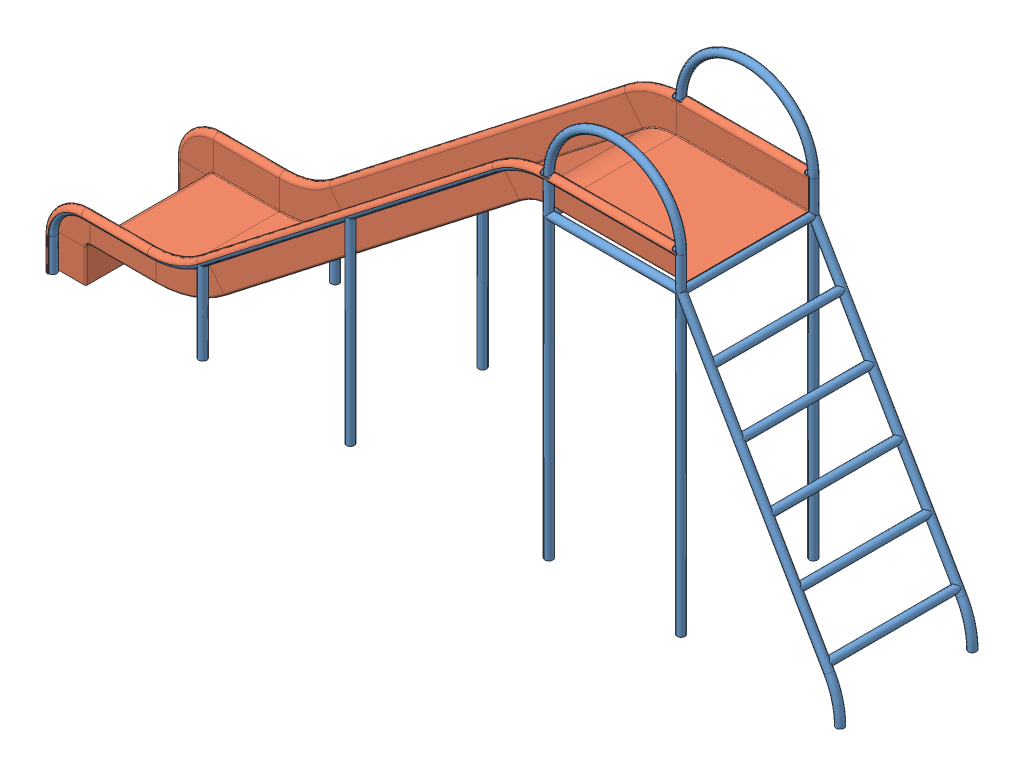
SolidWorks assembly Assem2.sldasm, configuration Default (file format 6000). Lengths in mm.
Overall size (4815.14 2424.13 858.26).
2 component instances, 2 part files, 0 mates.
Components (placement in the parent):
- Part1-1: Part1.SLDPRT [Default<As Machined>] at (2022.2882 1512.4055 4250.4022) size (4810.14 2424.13 850.98)
- Part2-1: Part2.sldprt [Default] at origin size (3829.13 2029.13 858.26)
